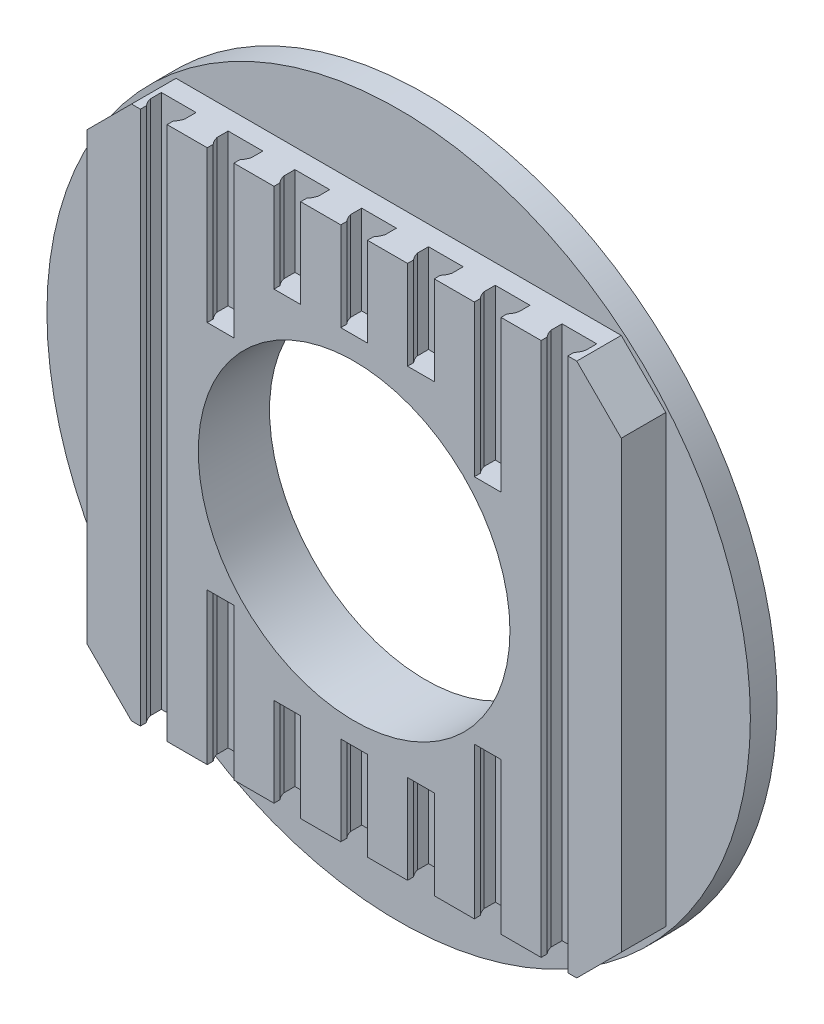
from build123d import *

# Parameters (mm, degrees)
SKETCH_1_R           = 45
EXTRUDE_1_DEPTH      = 5
SKETCH_2_W           = 60
SKETCH_2_H           = 60
EXTRUDE_2_DEPTH      = 5
CUT_EXTRUDE_1_DEPTH  = 10
CUT_EXTRUDE_START    = -50
CUT_EXTRUDE_2_DEPTH  = 10
CUT_EXTRUDE_3_DEPTH  = 17
CUT_EXTRUDE_START_2  = -43
CUT_EXTRUDE_4_DEPTH  = 17
CUT_EXTRUDE_5_REACH  = 89.607
CHAMFER_1_SIZE       = 5
SKETCH_6_R           = 17.5
CUT_EXTRUDE_6_DEPTH  = 3
SKETCH_7_R           = 15
CUT_EXTRUDE_7_DEPTH  = 65.02343321
SKETCH_8_R           = 45
CUT_EXTRUDE_9_DEPTH  = 10
SKETCH_12_R          = 39.5
EXTRUDE_3_DEPTH      = 3
SKETCH_13_R          = 15
CUT_EXTRUDE_10_DEPTH = 57.084757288
SKETCH_14_R          = 17.5
CUT_EXTRUDE_11_DEPTH = 57.084757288


with BuildPart() as part:
    # Sketch 1 → Extrude 1 (new body)
    with BuildSketch(Plane.XY):
        Circle(SKETCH_1_R)
    extrude(amount=-EXTRUDE_1_DEPTH)

    # Sketch 2 → Extrude 2 (add)
    with BuildSketch(Plane.XY):
        Rectangle(SKETCH_2_W, SKETCH_2_H)
    extrude(amount=EXTRUDE_2_DEPTH)

    # Sketch 3 → Cut-Extrude 1 (cut)
    with BuildSketch(Plane.XZ.offset(30)):
        with BuildLine():
            Line((-1.5, 5), (1.5, 5))
            Line((1.5, 5), (1.5, 4.322875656))
            ThreePointArc((1.5, 4.322875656), (1.780042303, 3.911838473), (1.95, 3.444409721))
            Line((1.95, 3.444409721), (1.95, 2.2))
            Line((1.95, 2.2), (-1.95, 2.2))
            Line((-1.95, 2.2), (-1.95, 3.444409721))
            ThreePointArc((-1.95, 3.444409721), (-1.780042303, 3.911838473), (-1.5, 4.322875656))
            Line((-1.5, 4.322875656), (-1.5, 5))
        make_face()
        with BuildLine():
            Line((6, 5), (6, 4.322875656))
            ThreePointArc((6, 4.322875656), (5.719957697, 3.911838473), (5.55, 3.444409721))
            Line((5.55, 3.444409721), (5.55, 2.2))
            Line((5.55, 2.2), (9.45, 2.2))
            Line((9.45, 2.2), (9.45, 3.444409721))
            ThreePointArc((9.45, 3.444409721), (9.280042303, 3.911838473), (9, 4.322875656))
            Line((9, 4.322875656), (9, 5))
            Line((9, 5), (6, 5))
        make_face()
        with BuildLine():
            Line((-9, 5), (-9, 4.322875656))
            ThreePointArc((-9, 4.322875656), (-9.280042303, 3.911838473), (-9.45, 3.444409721))
            Line((-9.45, 3.444409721), (-9.45, 2.2))
            Line((-9.45, 2.2), (-5.55, 2.2))
            Line((-5.55, 2.2), (-5.55, 3.444409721))
            ThreePointArc((-5.55, 3.444409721), (-5.719957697, 3.911838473), (-6, 4.322875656))
            Line((-6, 4.322875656), (-6, 5))
            Line((-6, 5), (-9, 5))
        make_face()
    extrude(amount=-CUT_EXTRUDE_1_DEPTH, mode=Mode.SUBTRACT)

    # Sketch 3_2 → Cut-Extrude 2 (cut)
    with BuildSketch(Plane.XZ.offset(30).offset(CUT_EXTRUDE_START)):
        with BuildLine():
            Line((-1.5, 5), (1.5, 5))
            Line((1.5, 5), (1.5, 4.322875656))
            ThreePointArc((1.5, 4.322875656), (1.780042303, 3.911838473), (1.95, 3.444409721))
            Line((1.95, 3.444409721), (1.95, 2.2))
            Line((1.95, 2.2), (-1.95, 2.2))
            Line((-1.95, 2.2), (-1.95, 3.444409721))
            ThreePointArc((-1.95, 3.444409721), (-1.780042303, 3.911838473), (-1.5, 4.322875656))
            Line((-1.5, 4.322875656), (-1.5, 5))
        make_face()
        with BuildLine():
            Line((6, 5), (6, 4.322875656))
            ThreePointArc((6, 4.322875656), (5.719957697, 3.911838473), (5.55, 3.444409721))
            Line((5.55, 3.444409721), (5.55, 2.2))
            Line((5.55, 2.2), (9.45, 2.2))
            Line((9.45, 2.2), (9.45, 3.444409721))
            ThreePointArc((9.45, 3.444409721), (9.280042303, 3.911838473), (9, 4.322875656))
            Line((9, 4.322875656), (9, 5))
            Line((9, 5), (6, 5))
        make_face()
        with BuildLine():
            Line((-9, 5), (-9, 4.322875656))
            ThreePointArc((-9, 4.322875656), (-9.280042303, 3.911838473), (-9.45, 3.444409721))
            Line((-9.45, 3.444409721), (-9.45, 2.2))
            Line((-9.45, 2.2), (-5.55, 2.2))
            Line((-5.55, 2.2), (-5.55, 3.444409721))
            ThreePointArc((-5.55, 3.444409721), (-5.719957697, 3.911838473), (-6, 4.322875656))
            Line((-6, 4.322875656), (-6, 5))
            Line((-6, 5), (-9, 5))
        make_face()
    extrude(amount=-CUT_EXTRUDE_2_DEPTH, mode=Mode.SUBTRACT)

    # Sketch 4 → Cut-Extrude 3 (cut)
    with BuildSketch(Plane.XZ.offset(30)):
        with BuildLine():
            Line((-16.5, 5), (-13.5, 5))
            Line((-13.5, 5), (-13.5, 4.322875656))
            ThreePointArc((-13.5, 4.322875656), (-13.219957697, 3.911838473), (-13.05, 3.444409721))
            Line((-13.05, 3.444409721), (-13.05, 2.2))
            Line((-13.05, 2.2), (-16.95, 2.2))
            Line((-16.95, 2.2), (-16.95, 3.444409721))
            ThreePointArc((-16.95, 3.444409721), (-16.780042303, 3.911838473), (-16.5, 4.322875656))
            Line((-16.5, 4.322875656), (-16.5, 5))
        make_face()
        with BuildLine():
            Line((13.5, 5), (16.5, 5))
            Line((16.5, 5), (16.5, 4.322875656))
            ThreePointArc((16.5, 4.322875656), (16.780042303, 3.911838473), (16.95, 3.444409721))
            Line((16.95, 3.444409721), (16.95, 2.2))
            Line((16.95, 2.2), (13.05, 2.2))
            Line((13.05, 2.2), (13.05, 3.444409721))
            ThreePointArc((13.05, 3.444409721), (13.219957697, 3.911838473), (13.5, 4.322875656))
            Line((13.5, 4.322875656), (13.5, 5))
        make_face()
    extrude(amount=-CUT_EXTRUDE_3_DEPTH, mode=Mode.SUBTRACT)

    # Sketch 4_2 → Cut-Extrude 4 (cut)
    with BuildSketch(Plane.XZ.offset(30).offset(CUT_EXTRUDE_START_2)):
        with BuildLine():
            Line((-16.5, 5), (-13.5, 5))
            Line((-13.5, 5), (-13.5, 4.322875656))
            ThreePointArc((-13.5, 4.322875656), (-13.219957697, 3.911838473), (-13.05, 3.444409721))
            Line((-13.05, 3.444409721), (-13.05, 2.2))
            Line((-13.05, 2.2), (-16.95, 2.2))
            Line((-16.95, 2.2), (-16.95, 3.444409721))
            ThreePointArc((-16.95, 3.444409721), (-16.780042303, 3.911838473), (-16.5, 4.322875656))
            Line((-16.5, 4.322875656), (-16.5, 5))
        make_face()
        with BuildLine():
            Line((13.5, 5), (16.5, 5))
            Line((16.5, 5), (16.5, 4.322875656))
            ThreePointArc((16.5, 4.322875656), (16.780042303, 3.911838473), (16.95, 3.444409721))
            Line((16.95, 3.444409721), (16.95, 2.2))
            Line((16.95, 2.2), (13.05, 2.2))
            Line((13.05, 2.2), (13.05, 3.444409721))
            ThreePointArc((13.05, 3.444409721), (13.219957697, 3.911838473), (13.5, 4.322875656))
            Line((13.5, 4.322875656), (13.5, 5))
        make_face()
    extrude(amount=-CUT_EXTRUDE_4_DEPTH, mode=Mode.SUBTRACT)

    # Sketch 5 → Cut-Extrude 5 (cut, up to next)
    with BuildSketch(Plane.XZ.offset(30), mode=Mode.PRIVATE) as cut_extrude_5_sk1:
        with BuildLine():
            Line((-21, 5), (-21, 4.322875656))
            ThreePointArc((-21, 4.322875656), (-20.719957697, 3.911838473), (-20.55, 3.444409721))
            Line((-20.55, 3.444409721), (-20.55, 2.2))
            Line((-20.55, 2.2), (-24.45, 2.2))
            Line((-24.45, 2.2), (-24.45, 3.444409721))
            ThreePointArc((-24.45, 3.444409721), (-24.280042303, 3.911838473), (-24, 4.322875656))
            Line((-24, 4.322875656), (-24, 5))
            Line((-24, 5), (-21, 5))
        make_face()
    cut_extrude_5_tool1 = extrude(cut_extrude_5_sk1.sketch, amount=-CUT_EXTRUDE_5_REACH, mode=Mode.PRIVATE) & part.part
    # Sketch 5 → Cut-Extrude 5 (cut, up to next)
    with BuildSketch(Plane.XZ.offset(30), mode=Mode.PRIVATE) as cut_extrude_5_sk2:
        with BuildLine():
            Line((24, 5), (24, 4.322875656))
            ThreePointArc((24, 4.322875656), (24.280042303, 3.911838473), (24.45, 3.444409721))
            Line((24.45, 3.444409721), (24.45, 2.2))
            Line((24.45, 2.2), (20.55, 2.2))
            Line((20.55, 2.2), (20.55, 3.444409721))
            ThreePointArc((20.55, 3.444409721), (20.719957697, 3.911838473), (21, 4.322875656))
            Line((21, 4.322875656), (21, 5))
            Line((21, 5), (24, 5))
        make_face()
    cut_extrude_5_tool2 = extrude(cut_extrude_5_sk2.sketch, amount=-CUT_EXTRUDE_5_REACH, mode=Mode.PRIVATE) & part.part
    add(cut_extrude_5_tool1.solids().sort_by_distance((-22.5, -30, 3.520698))[0], mode=Mode.SUBTRACT)
    add(cut_extrude_5_tool2.solids().sort_by_distance((22.5, -30, 3.520698))[0], mode=Mode.SUBTRACT)

    # Chamfer 1
    chamfer_1_edges = [part.edges().sort_by_distance(p)[0] for p in [
        (-30, 30, 2.5),
        (-30, -30, 2.5),
        (30, -30, 2.5),
        (30, 30, 2.5),
    ]]
    chamfer(chamfer_1_edges, length=CHAMFER_1_SIZE)

    # Sketch 6 → Cut-Extrude 6 (cut)
    with BuildSketch(Plane.XY.offset(5)):
        Circle(SKETCH_6_R)
    extrude(amount=-CUT_EXTRUDE_6_DEPTH, mode=Mode.SUBTRACT)

    # Sketch 7 → Cut-Extrude 7 (cut, through all)
    with BuildSketch(Plane.XY.offset(2)):
        Circle(SKETCH_7_R)
    extrude(amount=-CUT_EXTRUDE_7_DEPTH, mode=Mode.SUBTRACT)

    # Sketch 8 → Cut-Extrude 9 (cut)
    with BuildSketch(Plane.XY):
        Circle(SKETCH_8_R)
    extrude(amount=-CUT_EXTRUDE_9_DEPTH, mode=Mode.SUBTRACT)

    # Sketch 12 → Extrude 3 (add)
    with BuildSketch(Plane(origin=(0, 0, 0), x_dir=(-1, 0, 0), z_dir=(0, 0, -1))):
        Circle(SKETCH_12_R)
    extrude(amount=EXTRUDE_3_DEPTH)

    # Sketch 13 → Cut-Extrude 10 (cut, through all)
    with BuildSketch(Plane.XY):
        Circle(SKETCH_13_R)
    extrude(amount=-CUT_EXTRUDE_10_DEPTH, mode=Mode.SUBTRACT)

    # Sketch 14 → Cut-Extrude 11 (cut, through all)
    with BuildSketch(Plane.XY.offset(2)):
        Circle(SKETCH_14_R)
    extrude(amount=-CUT_EXTRUDE_11_DEPTH, mode=Mode.SUBTRACT)


solid = part.part
